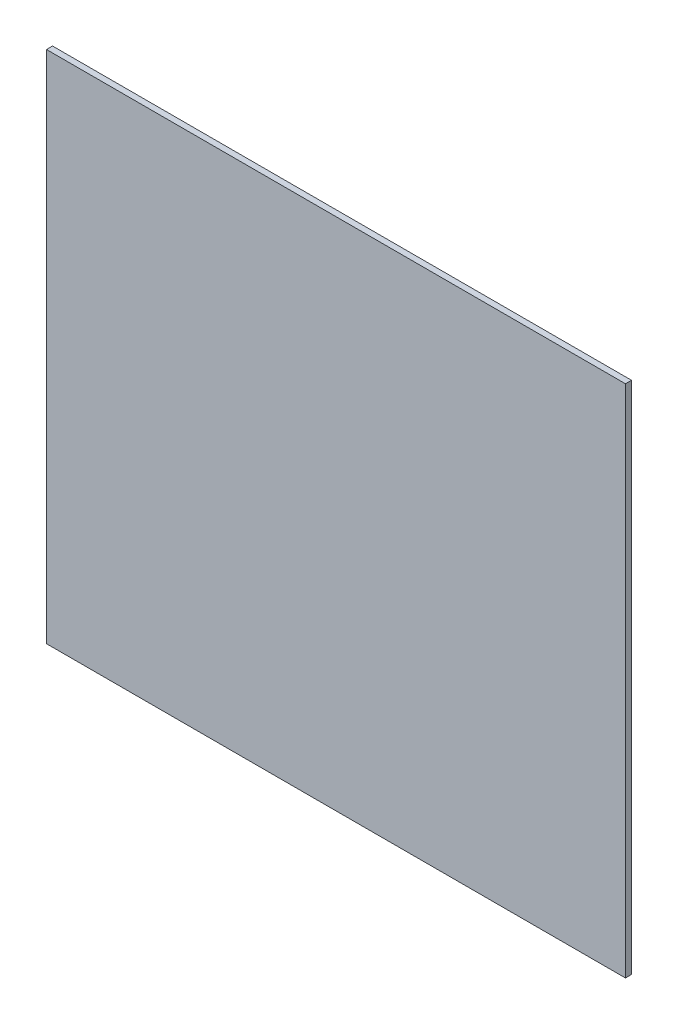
ISO-10303-21;
HEADER;
FILE_DESCRIPTION(('STEP AP214'),'2;1');
FILE_NAME('part.step','',(''),(''),'','','');
FILE_SCHEMA(('AUTOMOTIVE_DESIGN { 1 0 10303 214 1 1 1 1 }'));
ENDSEC;
DATA;
#1=APPLICATION_CONTEXT('core data for automotive mechanical design processes');
#2=APPLICATION_PROTOCOL_DEFINITION('international standard','automotive_design',2000,#1);
#3=PRODUCT_CONTEXT('',#1,'mechanical');
#4=PRODUCT('Part','Part','',(#3));
#5=PRODUCT_RELATED_PRODUCT_CATEGORY('part','',(#4));
#6=PRODUCT_DEFINITION_FORMATION('','',#4);
#7=PRODUCT_DEFINITION_CONTEXT('part definition',#1,'design');
#8=PRODUCT_DEFINITION('design','',#6,#7);
#9=PRODUCT_DEFINITION_SHAPE('','',#8);
#10=(LENGTH_UNIT() NAMED_UNIT(*) SI_UNIT(.MILLI.,.METRE.));
#11=(NAMED_UNIT(*) PLANE_ANGLE_UNIT() SI_UNIT($,.RADIAN.));
#12=(NAMED_UNIT(*) SI_UNIT($,.STERADIAN.) SOLID_ANGLE_UNIT());
#13=UNCERTAINTY_MEASURE_WITH_UNIT(LENGTH_MEASURE(1.E-05),#10,'distance_accuracy_value','');
#14=(GEOMETRIC_REPRESENTATION_CONTEXT(3) GLOBAL_UNCERTAINTY_ASSIGNED_CONTEXT((#13)) GLOBAL_UNIT_ASSIGNED_CONTEXT((#10,
#11,#12)) REPRESENTATION_CONTEXT('',''));
#15=CARTESIAN_POINT('',(0.,0.,0.));
#16=DIRECTION('',(0.,0.,1.));
#17=DIRECTION('',(1.,0.,0.));
#18=AXIS2_PLACEMENT_3D('',#15,#16,#17);
#19=CARTESIAN_POINT('',(-72.0845302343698,46.0647131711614,-1.27));
#20=DIRECTION('',(-1.,0.,0.));
#21=DIRECTION('',(0.,0.,1.));
#22=AXIS2_PLACEMENT_3D('',#19,#20,#21);
#23=PLANE('',#22);
#24=DIRECTION('',(0.,-1.,0.));
#25=VECTOR('',#24,1.);
#26=CARTESIAN_POINT('',(-72.0845302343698,46.0647131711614,0.));
#27=LINE('',#26,#25);
#28=CARTESIAN_POINT('',(-72.0845302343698,46.0647131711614,0.));
#29=VERTEX_POINT('',#28);
#30=CARTESIAN_POINT('',(-72.0845302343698,-61.8693427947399,0.));
#31=VERTEX_POINT('',#30);
#32=EDGE_CURVE('E98',#29,#31,#27,.T.);
#33=ORIENTED_EDGE('',*,*,#32,.F.);
#34=DIRECTION('',(0.,0.,1.));
#35=VECTOR('',#34,1.);
#36=CARTESIAN_POINT('',(-72.0845302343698,46.0647131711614,-1.27));
#37=LINE('',#36,#35);
#38=CARTESIAN_POINT('',(-72.0845302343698,46.0647131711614,-1.27));
#39=VERTEX_POINT('',#38);
#40=EDGE_CURVE('E11',#39,#29,#37,.T.);
#41=ORIENTED_EDGE('',*,*,#40,.F.);
#42=DIRECTION('',(0.,-1.,0.));
#43=VECTOR('',#42,1.);
#44=CARTESIAN_POINT('',(-72.0845302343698,46.0647131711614,-1.27));
#45=LINE('',#44,#43);
#46=CARTESIAN_POINT('',(-72.0845302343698,-61.8693427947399,-1.27));
#47=VERTEX_POINT('',#46);
#48=EDGE_CURVE('E92',#39,#47,#45,.T.);
#49=ORIENTED_EDGE('',*,*,#48,.T.);
#50=DIRECTION('',(0.,0.,1.));
#51=VECTOR('',#50,1.);
#52=CARTESIAN_POINT('',(-72.0845302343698,-61.8693427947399,-1.27));
#53=LINE('',#52,#51);
#54=EDGE_CURVE('E37',#47,#31,#53,.T.);
#55=ORIENTED_EDGE('',*,*,#54,.T.);
#56=EDGE_LOOP('',(#33,#41,#49,#55));
#57=FACE_BOUND('',#56,.T.);
#58=ADVANCED_FACE('F34',(#57),#23,.T.);
#59=CARTESIAN_POINT('',(-72.0845302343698,46.0647131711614,-1.27));
#60=DIRECTION('',(0.,1.,0.));
#61=DIRECTION('',(0.,0.,1.));
#62=AXIS2_PLACEMENT_3D('',#59,#60,#61);
#63=PLANE('',#62);
#64=DIRECTION('',(-1.,0.,0.));
#65=VECTOR('',#64,1.);
#66=CARTESIAN_POINT('',(-72.0845302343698,46.0647131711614,0.));
#67=LINE('',#66,#65);
#68=CARTESIAN_POINT('',(49.3412827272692,46.0647131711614,0.));
#69=VERTEX_POINT('',#68);
#70=EDGE_CURVE('E94',#69,#29,#67,.T.);
#71=ORIENTED_EDGE('',*,*,#70,.F.);
#72=DIRECTION('',(0.,0.,1.));
#73=VECTOR('',#72,1.);
#74=CARTESIAN_POINT('',(49.3412827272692,46.0647131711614,-1.27));
#75=LINE('',#74,#73);
#76=CARTESIAN_POINT('',(49.3412827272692,46.0647131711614,-1.27));
#77=VERTEX_POINT('',#76);
#78=EDGE_CURVE('E43',#77,#69,#75,.T.);
#79=ORIENTED_EDGE('',*,*,#78,.F.);
#80=DIRECTION('',(-1.,0.,0.));
#81=VECTOR('',#80,1.);
#82=CARTESIAN_POINT('',(-72.0845302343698,46.0647131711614,-1.27));
#83=LINE('',#82,#81);
#84=EDGE_CURVE('E89',#77,#39,#83,.T.);
#85=ORIENTED_EDGE('',*,*,#84,.T.);
#86=ORIENTED_EDGE('',*,*,#40,.T.);
#87=EDGE_LOOP('',(#71,#79,#85,#86));
#88=FACE_BOUND('',#87,.T.);
#89=ADVANCED_FACE('F108',(#88),#63,.T.);
#90=CARTESIAN_POINT('',(49.3412827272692,46.0647131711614,-1.27));
#91=DIRECTION('',(1.,0.,0.));
#92=DIRECTION('',(0.,0.,-1.));
#93=AXIS2_PLACEMENT_3D('',#90,#91,#92);
#94=PLANE('',#93);
#95=DIRECTION('',(0.,1.,0.));
#96=VECTOR('',#95,1.);
#97=CARTESIAN_POINT('',(49.3412827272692,46.0647131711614,0.));
#98=LINE('',#97,#96);
#99=CARTESIAN_POINT('',(49.3412827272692,-61.8693427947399,0.));
#100=VERTEX_POINT('',#99);
#101=EDGE_CURVE('E84',#100,#69,#98,.T.);
#102=ORIENTED_EDGE('',*,*,#101,.F.);
#103=DIRECTION('',(0.,0.,1.));
#104=VECTOR('',#103,1.);
#105=CARTESIAN_POINT('',(49.3412827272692,-61.8693427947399,-1.27));
#106=LINE('',#105,#104);
#107=CARTESIAN_POINT('',(49.3412827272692,-61.8693427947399,-1.27));
#108=VERTEX_POINT('',#107);
#109=EDGE_CURVE('E79',#108,#100,#106,.T.);
#110=ORIENTED_EDGE('',*,*,#109,.F.);
#111=DIRECTION('',(0.,1.,0.));
#112=VECTOR('',#111,1.);
#113=CARTESIAN_POINT('',(49.3412827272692,46.0647131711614,-1.27));
#114=LINE('',#113,#112);
#115=EDGE_CURVE('E82',#108,#77,#114,.T.);
#116=ORIENTED_EDGE('',*,*,#115,.T.);
#117=ORIENTED_EDGE('',*,*,#78,.T.);
#118=EDGE_LOOP('',(#102,#110,#116,#117));
#119=FACE_BOUND('',#118,.T.);
#120=ADVANCED_FACE('F81',(#119),#94,.T.);
#121=CARTESIAN_POINT('',(-72.0845302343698,-61.8693427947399,-1.27));
#122=DIRECTION('',(0.,-1.,0.));
#123=DIRECTION('',(0.,0.,-1.));
#124=AXIS2_PLACEMENT_3D('',#121,#122,#123);
#125=PLANE('',#124);
#126=DIRECTION('',(1.,0.,0.));
#127=VECTOR('',#126,1.);
#128=CARTESIAN_POINT('',(-72.0845302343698,-61.8693427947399,0.));
#129=LINE('',#128,#127);
#130=EDGE_CURVE('E101',#31,#100,#129,.T.);
#131=ORIENTED_EDGE('',*,*,#130,.F.);
#132=ORIENTED_EDGE('',*,*,#54,.F.);
#133=DIRECTION('',(1.,0.,0.));
#134=VECTOR('',#133,1.);
#135=CARTESIAN_POINT('',(-72.0845302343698,-61.8693427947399,-1.27));
#136=LINE('',#135,#134);
#137=EDGE_CURVE('E88',#47,#108,#136,.T.);
#138=ORIENTED_EDGE('',*,*,#137,.T.);
#139=ORIENTED_EDGE('',*,*,#109,.T.);
#140=EDGE_LOOP('',(#131,#132,#138,#139));
#141=FACE_BOUND('',#140,.T.);
#142=ADVANCED_FACE('F91',(#141),#125,.T.);
#143=CARTESIAN_POINT('',(0.,0.,-1.27));
#144=DIRECTION('',(0.,0.,1.));
#145=DIRECTION('',(1.,0.,0.));
#146=AXIS2_PLACEMENT_3D('',#143,#144,#145);
#147=PLANE('',#146);
#148=ORIENTED_EDGE('',*,*,#48,.F.);
#149=ORIENTED_EDGE('',*,*,#84,.F.);
#150=ORIENTED_EDGE('',*,*,#115,.F.);
#151=ORIENTED_EDGE('',*,*,#137,.F.);
#152=EDGE_LOOP('',(#148,#149,#150,#151));
#153=FACE_BOUND('',#152,.T.);
#154=ADVANCED_FACE('F87',(#153),#147,.F.);
#155=CARTESIAN_POINT('',(0.,0.,0.));
#156=DIRECTION('',(0.,0.,1.));
#157=DIRECTION('',(1.,0.,0.));
#158=AXIS2_PLACEMENT_3D('',#155,#156,#157);
#159=PLANE('',#158);
#160=ORIENTED_EDGE('',*,*,#32,.T.);
#161=ORIENTED_EDGE('',*,*,#130,.T.);
#162=ORIENTED_EDGE('',*,*,#101,.T.);
#163=ORIENTED_EDGE('',*,*,#70,.T.);
#164=EDGE_LOOP('',(#160,#161,#162,#163));
#165=FACE_BOUND('',#164,.T.);
#166=ADVANCED_FACE('F107',(#165),#159,.T.);
#167=CLOSED_SHELL('',(#58,#89,#120,#142,#154,#166));
#168=MANIFOLD_SOLID_BREP('B2',#167);
#169=ADVANCED_BREP_SHAPE_REPRESENTATION('',(#18,#168),#14);
#170=SHAPE_DEFINITION_REPRESENTATION(#9,#169);
ENDSEC;
END-ISO-10303-21;
